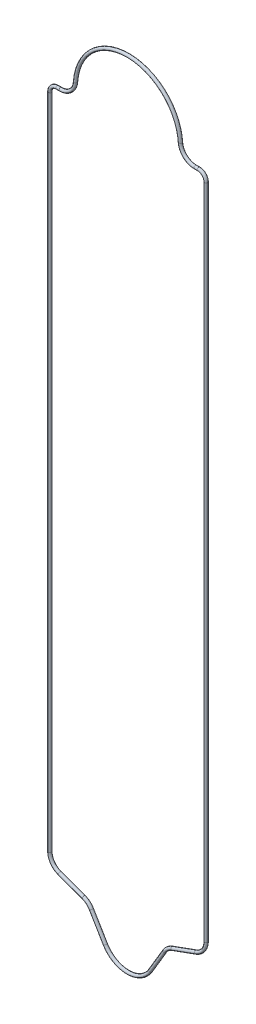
from build123d import *

# Parameters (mm, degrees)
ESQUISSE2_R = 0.206304


with BuildPart() as part:
    # Balayage1: sweep along a path in Esquisse1
    with BuildLine(Plane.XY) as balayage1_path:
        Line((-8.97929535, -1.389872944), (-9.406475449, -1.389872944))
        ThreePointArc((-9.406475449, -1.389872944), (-10.11358223, -1.682766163), (-10.406475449, -2.389872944))
        Line((-10.406475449, -2.389872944), (-10.406475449, -89.989457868))
        ThreePointArc((-10.406475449, -89.989457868), (-10.044779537, -91.136610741), (-9.090515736, -91.868843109))
        Line((-9.090515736, -91.868843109), (-5.909900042, -93.026492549))
        ThreePointArc((-5.909900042, -93.026492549), (-5.317263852, -93.366365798), (-4.873593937, -93.885873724))
        Line((-4.873593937, -93.885873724), (-3.010606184, -97.028002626))
        ThreePointArc((-3.010606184, -97.028002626), (-1.73240802, -98.284173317), (0, -98.74299551))
        ThreePointArc((0, -98.74299551), (1.73240802, -98.284173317), (3.010606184, -97.028002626))
        Line((3.010606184, -97.028002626), (4.873593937, -93.885873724))
        ThreePointArc((4.873593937, -93.885873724), (5.317263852, -93.366365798), (5.909900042, -93.026492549))
        Line((5.909900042, -93.026492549), (9.090515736, -91.868843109))
        ThreePointArc((9.090515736, -91.868843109), (10.044779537, -91.136610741), (10.406475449, -89.989457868))
        Line((10.406475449, -89.989457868), (10.406475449, -2.389872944))
        ThreePointArc((10.406475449, -2.389872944), (10.11358223, -1.682766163), (9.406475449, -1.389872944))
        Line((9.406475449, -1.389872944), (8.97929535, -1.389872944))
        ThreePointArc((8.97929535, -1.389872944), (7.613859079, -0.851236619), (6.983896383, 0.474543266))
        ThreePointArc((6.983896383, 0.474543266), (0, 7), (-6.983896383, 0.474543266))
        ThreePointArc((-6.983896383, 0.474543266), (-7.613859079, -0.851236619), (-8.97929535, -1.389872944))
    # Esquisse2 → Balayage1 (sweep)
    with BuildSketch(Plane(origin=(0, 0, 0), x_dir=(0, 0, -1), z_dir=(1, 0, 0))):
        with Locations((0, 7)):
            Circle(ESQUISSE2_R)
    sweep(path=balayage1_path.line)


solid = part.part
